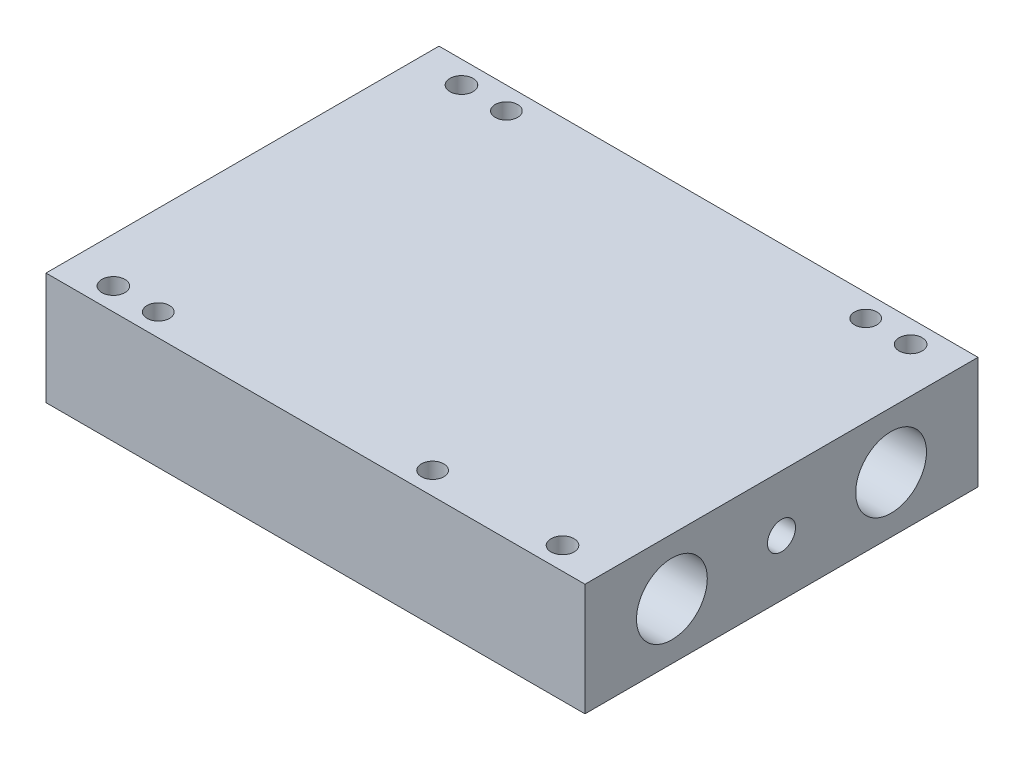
ISO-10303-21;
HEADER;
FILE_DESCRIPTION(('STEP AP214'),'2;1');
FILE_NAME('part.step','',(''),(''),'','','');
FILE_SCHEMA(('AUTOMOTIVE_DESIGN { 1 0 10303 214 1 1 1 1 }'));
ENDSEC;
DATA;
#1=APPLICATION_CONTEXT('core data for automotive mechanical design processes');
#2=APPLICATION_PROTOCOL_DEFINITION('international standard','automotive_design',2000,#1);
#3=PRODUCT_CONTEXT('',#1,'mechanical');
#4=PRODUCT('Part','Part','',(#3));
#5=PRODUCT_RELATED_PRODUCT_CATEGORY('part','',(#4));
#6=PRODUCT_DEFINITION_FORMATION('','',#4);
#7=PRODUCT_DEFINITION_CONTEXT('part definition',#1,'design');
#8=PRODUCT_DEFINITION('design','',#6,#7);
#9=PRODUCT_DEFINITION_SHAPE('','',#8);
#10=(LENGTH_UNIT() NAMED_UNIT(*) SI_UNIT(.MILLI.,.METRE.));
#11=(NAMED_UNIT(*) PLANE_ANGLE_UNIT() SI_UNIT($,.RADIAN.));
#12=(NAMED_UNIT(*) SI_UNIT($,.STERADIAN.) SOLID_ANGLE_UNIT());
#13=UNCERTAINTY_MEASURE_WITH_UNIT(LENGTH_MEASURE(1.E-05),#10,'distance_accuracy_value','');
#14=(GEOMETRIC_REPRESENTATION_CONTEXT(3) GLOBAL_UNCERTAINTY_ASSIGNED_CONTEXT((#13)) GLOBAL_UNIT_ASSIGNED_CONTEXT((#10,
#11,#12)) REPRESENTATION_CONTEXT('',''));
#15=CARTESIAN_POINT('',(0.,0.,0.));
#16=DIRECTION('',(0.,0.,1.));
#17=DIRECTION('',(1.,0.,0.));
#18=AXIS2_PLACEMENT_3D('',#15,#16,#17);
#19=CARTESIAN_POINT('',(76.2,15.875,-55.5625));
#20=DIRECTION('',(0.,-1.,0.));
#21=DIRECTION('',(0.,0.,-1.));
#22=AXIS2_PLACEMENT_3D('',#19,#20,#21);
#23=PLANE('',#22);
#24=CARTESIAN_POINT('',(-50.8,15.875,-49.2125));
#25=DIRECTION('',(0.,1.,0.));
#26=DIRECTION('',(0.,0.,1.));
#27=AXIS2_PLACEMENT_3D('',#24,#25,#26);
#28=CIRCLE('',#27,3.17500000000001);
#29=CARTESIAN_POINT('',(-50.8,15.875,-46.0375));
#30=VERTEX_POINT('',#29);
#31=EDGE_CURVE('E178',#30,#30,#28,.T.);
#32=ORIENTED_EDGE('',*,*,#31,.F.);
#33=EDGE_LOOP('',(#32));
#34=FACE_BOUND('',#33,.T.);
#35=CARTESIAN_POINT('',(-50.8,15.875,49.2125));
#36=DIRECTION('',(0.,1.,0.));
#37=DIRECTION('',(0.,0.,1.));
#38=AXIS2_PLACEMENT_3D('',#35,#36,#37);
#39=CIRCLE('',#38,3.17500000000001);
#40=CARTESIAN_POINT('',(-50.8,15.875,52.3875));
#41=VERTEX_POINT('',#40);
#42=EDGE_CURVE('E182',#41,#41,#39,.T.);
#43=ORIENTED_EDGE('',*,*,#42,.F.);
#44=EDGE_LOOP('',(#43));
#45=FACE_BOUND('',#44,.T.);
#46=CARTESIAN_POINT('',(50.8,15.875,-49.2125));
#47=DIRECTION('',(0.,1.,0.));
#48=DIRECTION('',(0.,0.,1.));
#49=AXIS2_PLACEMENT_3D('',#46,#47,#48);
#50=CIRCLE('',#49,3.17500000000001);
#51=CARTESIAN_POINT('',(50.8,15.875,-46.0375));
#52=VERTEX_POINT('',#51);
#53=EDGE_CURVE('E186',#52,#52,#50,.T.);
#54=ORIENTED_EDGE('',*,*,#53,.F.);
#55=EDGE_LOOP('',(#54));
#56=FACE_BOUND('',#55,.T.);
#57=CARTESIAN_POINT('',(26.7628980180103,15.875,49.2125));
#58=DIRECTION('',(0.,1.,0.));
#59=DIRECTION('',(0.,0.,1.));
#60=AXIS2_PLACEMENT_3D('',#57,#58,#59);
#61=CIRCLE('',#60,3.17500000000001);
#62=CARTESIAN_POINT('',(26.7628980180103,15.875,52.3875));
#63=VERTEX_POINT('',#62);
#64=EDGE_CURVE('E190',#63,#63,#61,.T.);
#65=ORIENTED_EDGE('',*,*,#64,.F.);
#66=EDGE_LOOP('',(#65));
#67=FACE_BOUND('',#66,.T.);
#68=CARTESIAN_POINT('',(-63.5,15.875,-49.2125));
#69=DIRECTION('',(0.,1.,0.));
#70=DIRECTION('',(0.,0.,1.));
#71=AXIS2_PLACEMENT_3D('',#68,#69,#70);
#72=CIRCLE('',#71,3.2639);
#73=CARTESIAN_POINT('',(-63.5,15.875,-45.9486));
#74=VERTEX_POINT('',#73);
#75=EDGE_CURVE('E108',#74,#74,#72,.T.);
#76=ORIENTED_EDGE('',*,*,#75,.F.);
#77=EDGE_LOOP('',(#76));
#78=FACE_BOUND('',#77,.T.);
#79=CARTESIAN_POINT('',(63.5,15.875,-49.2125));
#80=DIRECTION('',(0.,1.,0.));
#81=DIRECTION('',(0.,0.,1.));
#82=AXIS2_PLACEMENT_3D('',#79,#80,#81);
#83=CIRCLE('',#82,3.2639);
#84=CARTESIAN_POINT('',(63.5,15.875,-45.9486));
#85=VERTEX_POINT('',#84);
#86=EDGE_CURVE('E107',#85,#85,#83,.T.);
#87=ORIENTED_EDGE('',*,*,#86,.F.);
#88=EDGE_LOOP('',(#87));
#89=FACE_BOUND('',#88,.T.);
#90=CARTESIAN_POINT('',(63.5,15.875,49.2125));
#91=DIRECTION('',(0.,1.,0.));
#92=DIRECTION('',(0.,0.,1.));
#93=AXIS2_PLACEMENT_3D('',#90,#91,#92);
#94=CIRCLE('',#93,3.2639);
#95=CARTESIAN_POINT('',(63.5,15.875,52.4764));
#96=VERTEX_POINT('',#95);
#97=EDGE_CURVE('E120',#96,#96,#94,.T.);
#98=ORIENTED_EDGE('',*,*,#97,.F.);
#99=EDGE_LOOP('',(#98));
#100=FACE_BOUND('',#99,.T.);
#101=CARTESIAN_POINT('',(-63.5,15.875,49.2125));
#102=DIRECTION('',(0.,1.,0.));
#103=DIRECTION('',(0.,0.,1.));
#104=AXIS2_PLACEMENT_3D('',#101,#102,#103);
#105=CIRCLE('',#104,3.2639);
#106=CARTESIAN_POINT('',(-63.5,15.875,52.4764));
#107=VERTEX_POINT('',#106);
#108=EDGE_CURVE('E126',#107,#107,#105,.T.);
#109=ORIENTED_EDGE('',*,*,#108,.F.);
#110=EDGE_LOOP('',(#109));
#111=FACE_BOUND('',#110,.T.);
#112=DIRECTION('',(0.,0.,1.));
#113=VECTOR('',#112,1.);
#114=CARTESIAN_POINT('',(-76.2,15.875,-55.5625));
#115=LINE('',#114,#113);
#116=CARTESIAN_POINT('',(-76.2,15.875,-55.5625));
#117=VERTEX_POINT('',#116);
#118=CARTESIAN_POINT('',(-76.2,15.875,55.5625));
#119=VERTEX_POINT('',#118);
#120=EDGE_CURVE('E132',#117,#119,#115,.T.);
#121=ORIENTED_EDGE('',*,*,#120,.T.);
#122=DIRECTION('',(-1.,0.,0.));
#123=VECTOR('',#122,1.);
#124=CARTESIAN_POINT('',(76.2,15.875,55.5625));
#125=LINE('',#124,#123);
#126=CARTESIAN_POINT('',(76.2,15.875,55.5625));
#127=VERTEX_POINT('',#126);
#128=EDGE_CURVE('E11',#127,#119,#125,.T.);
#129=ORIENTED_EDGE('',*,*,#128,.F.);
#130=DIRECTION('',(0.,0.,1.));
#131=VECTOR('',#130,1.);
#132=CARTESIAN_POINT('',(76.2,15.875,-55.5625));
#133=LINE('',#132,#131);
#134=CARTESIAN_POINT('',(76.2,15.875,-55.5625));
#135=VERTEX_POINT('',#134);
#136=EDGE_CURVE('E133',#135,#127,#133,.T.);
#137=ORIENTED_EDGE('',*,*,#136,.F.);
#138=DIRECTION('',(-1.,0.,0.));
#139=VECTOR('',#138,1.);
#140=CARTESIAN_POINT('',(76.2,15.875,-55.5625));
#141=LINE('',#140,#139);
#142=EDGE_CURVE('E139',#135,#117,#141,.T.);
#143=ORIENTED_EDGE('',*,*,#142,.T.);
#144=EDGE_LOOP('',(#121,#129,#137,#143));
#145=FACE_BOUND('',#144,.T.);
#146=ADVANCED_FACE('F37',(#34,#45,#56,#67,#78,#89,#100,#111,#145),#23,.F.);
#147=CARTESIAN_POINT('',(76.2,15.875,55.5625));
#148=DIRECTION('',(0.,0.,-1.));
#149=DIRECTION('',(-1.,0.,0.));
#150=AXIS2_PLACEMENT_3D('',#147,#148,#149);
#151=PLANE('',#150);
#152=DIRECTION('',(0.,-1.,0.));
#153=VECTOR('',#152,1.);
#154=CARTESIAN_POINT('',(-76.2,15.875,55.5625));
#155=LINE('',#154,#153);
#156=CARTESIAN_POINT('',(-76.2,-15.875,55.5625));
#157=VERTEX_POINT('',#156);
#158=EDGE_CURVE('E142',#119,#157,#155,.T.);
#159=ORIENTED_EDGE('',*,*,#158,.T.);
#160=DIRECTION('',(-1.,0.,0.));
#161=VECTOR('',#160,1.);
#162=CARTESIAN_POINT('',(76.2,-15.875,55.5625));
#163=LINE('',#162,#161);
#164=CARTESIAN_POINT('',(76.2,-15.875,55.5625));
#165=VERTEX_POINT('',#164);
#166=EDGE_CURVE('E45',#165,#157,#163,.T.);
#167=ORIENTED_EDGE('',*,*,#166,.F.);
#168=DIRECTION('',(0.,-1.,0.));
#169=VECTOR('',#168,1.);
#170=CARTESIAN_POINT('',(76.2,15.875,55.5625));
#171=LINE('',#170,#169);
#172=EDGE_CURVE('E84',#127,#165,#171,.T.);
#173=ORIENTED_EDGE('',*,*,#172,.F.);
#174=ORIENTED_EDGE('',*,*,#128,.T.);
#175=EDGE_LOOP('',(#159,#167,#173,#174));
#176=FACE_BOUND('',#175,.T.);
#177=ADVANCED_FACE('F166',(#176),#151,.F.);
#178=CARTESIAN_POINT('',(76.2,-15.875,55.5625));
#179=DIRECTION('',(0.,1.,0.));
#180=DIRECTION('',(0.,0.,1.));
#181=AXIS2_PLACEMENT_3D('',#178,#179,#180);
#182=PLANE('',#181);
#183=CARTESIAN_POINT('',(-50.8,-15.875,-49.2125));
#184=DIRECTION('',(0.,1.,0.));
#185=DIRECTION('',(0.,0.,1.));
#186=AXIS2_PLACEMENT_3D('',#183,#184,#185);
#187=CIRCLE('',#186,3.17500000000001);
#188=CARTESIAN_POINT('',(-50.8,-15.875,-46.0375));
#189=VERTEX_POINT('',#188);
#190=EDGE_CURVE('E234',#189,#189,#187,.T.);
#191=ORIENTED_EDGE('',*,*,#190,.T.);
#192=EDGE_LOOP('',(#191));
#193=FACE_BOUND('',#192,.T.);
#194=CARTESIAN_POINT('',(-50.8,-15.875,49.2125));
#195=DIRECTION('',(0.,1.,0.));
#196=DIRECTION('',(0.,0.,1.));
#197=AXIS2_PLACEMENT_3D('',#194,#195,#196);
#198=CIRCLE('',#197,3.17500000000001);
#199=CARTESIAN_POINT('',(-50.8,-15.875,52.3875));
#200=VERTEX_POINT('',#199);
#201=EDGE_CURVE('E245',#200,#200,#198,.T.);
#202=ORIENTED_EDGE('',*,*,#201,.T.);
#203=EDGE_LOOP('',(#202));
#204=FACE_BOUND('',#203,.T.);
#205=CARTESIAN_POINT('',(50.8,-15.875,-49.2125));
#206=DIRECTION('',(0.,1.,0.));
#207=DIRECTION('',(0.,0.,1.));
#208=AXIS2_PLACEMENT_3D('',#205,#206,#207);
#209=CIRCLE('',#208,3.17500000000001);
#210=CARTESIAN_POINT('',(50.8,-15.875,-46.0375));
#211=VERTEX_POINT('',#210);
#212=EDGE_CURVE('E249',#211,#211,#209,.T.);
#213=ORIENTED_EDGE('',*,*,#212,.T.);
#214=EDGE_LOOP('',(#213));
#215=FACE_BOUND('',#214,.T.);
#216=CARTESIAN_POINT('',(26.7628980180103,-15.875,49.2125));
#217=DIRECTION('',(0.,1.,0.));
#218=DIRECTION('',(0.,0.,1.));
#219=AXIS2_PLACEMENT_3D('',#216,#217,#218);
#220=CIRCLE('',#219,3.17500000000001);
#221=CARTESIAN_POINT('',(26.7628980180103,-15.875,52.3875));
#222=VERTEX_POINT('',#221);
#223=EDGE_CURVE('E114',#222,#222,#220,.T.);
#224=ORIENTED_EDGE('',*,*,#223,.T.);
#225=EDGE_LOOP('',(#224));
#226=FACE_BOUND('',#225,.T.);
#227=DIRECTION('',(0.,0.,-1.));
#228=VECTOR('',#227,1.);
#229=CARTESIAN_POINT('',(-76.2,-15.875,55.5625));
#230=LINE('',#229,#228);
#231=CARTESIAN_POINT('',(-76.2,-15.875,-55.5625));
#232=VERTEX_POINT('',#231);
#233=EDGE_CURVE('E71',#157,#232,#230,.T.);
#234=ORIENTED_EDGE('',*,*,#233,.T.);
#235=DIRECTION('',(-1.,0.,0.));
#236=VECTOR('',#235,1.);
#237=CARTESIAN_POINT('',(76.2,-15.875,-55.5625));
#238=LINE('',#237,#236);
#239=CARTESIAN_POINT('',(76.2,-15.875,-55.5625));
#240=VERTEX_POINT('',#239);
#241=EDGE_CURVE('E147',#240,#232,#238,.T.);
#242=ORIENTED_EDGE('',*,*,#241,.F.);
#243=DIRECTION('',(0.,0.,-1.));
#244=VECTOR('',#243,1.);
#245=CARTESIAN_POINT('',(76.2,-15.875,55.5625));
#246=LINE('',#245,#244);
#247=EDGE_CURVE('E136',#165,#240,#246,.T.);
#248=ORIENTED_EDGE('',*,*,#247,.F.);
#249=ORIENTED_EDGE('',*,*,#166,.T.);
#250=EDGE_LOOP('',(#234,#242,#248,#249));
#251=FACE_BOUND('',#250,.T.);
#252=ADVANCED_FACE('F149',(#193,#204,#215,#226,#251),#182,.F.);
#253=CARTESIAN_POINT('',(76.2,-15.875,-55.5625));
#254=DIRECTION('',(0.,0.,1.));
#255=DIRECTION('',(1.,0.,0.));
#256=AXIS2_PLACEMENT_3D('',#253,#254,#255);
#257=PLANE('',#256);
#258=DIRECTION('',(0.,1.,0.));
#259=VECTOR('',#258,1.);
#260=CARTESIAN_POINT('',(-76.2,-15.875,-55.5625));
#261=LINE('',#260,#259);
#262=EDGE_CURVE('E77',#232,#117,#261,.T.);
#263=ORIENTED_EDGE('',*,*,#262,.T.);
#264=ORIENTED_EDGE('',*,*,#142,.F.);
#265=DIRECTION('',(0.,1.,0.));
#266=VECTOR('',#265,1.);
#267=CARTESIAN_POINT('',(76.2,-15.875,-55.5625));
#268=LINE('',#267,#266);
#269=EDGE_CURVE('E53',#240,#135,#268,.T.);
#270=ORIENTED_EDGE('',*,*,#269,.F.);
#271=ORIENTED_EDGE('',*,*,#241,.T.);
#272=EDGE_LOOP('',(#263,#264,#270,#271));
#273=FACE_BOUND('',#272,.T.);
#274=ADVANCED_FACE('F156',(#273),#257,.F.);
#275=CARTESIAN_POINT('',(76.2,15.875,55.5625));
#276=DIRECTION('',(1.,0.,0.));
#277=DIRECTION('',(0.,0.,-1.));
#278=AXIS2_PLACEMENT_3D('',#275,#276,#277);
#279=PLANE('',#278);
#280=CARTESIAN_POINT('',(76.2,0.,0.));
#281=DIRECTION('',(1.,0.,0.));
#282=DIRECTION('',(0.,0.,-1.));
#283=AXIS2_PLACEMENT_3D('',#280,#281,#282);
#284=CIRCLE('',#283,3.96875);
#285=CARTESIAN_POINT('',(76.2,0.,-3.96875));
#286=VERTEX_POINT('',#285);
#287=EDGE_CURVE('E403',#286,#286,#284,.T.);
#288=ORIENTED_EDGE('',*,*,#287,.F.);
#289=EDGE_LOOP('',(#288));
#290=FACE_BOUND('',#289,.T.);
#291=CARTESIAN_POINT('',(76.2,0.,-30.988));
#292=DIRECTION('',(1.,0.,0.));
#293=DIRECTION('',(0.,0.,-1.));
#294=AXIS2_PLACEMENT_3D('',#291,#292,#293);
#295=CIRCLE('',#294,10.0076);
#296=CARTESIAN_POINT('',(76.2,0.,-40.9956));
#297=VERTEX_POINT('',#296);
#298=EDGE_CURVE('E239',#297,#297,#295,.T.);
#299=ORIENTED_EDGE('',*,*,#298,.F.);
#300=EDGE_LOOP('',(#299));
#301=FACE_BOUND('',#300,.T.);
#302=CARTESIAN_POINT('',(76.2,0.,30.988));
#303=DIRECTION('',(1.,0.,0.));
#304=DIRECTION('',(0.,0.,-1.));
#305=AXIS2_PLACEMENT_3D('',#302,#303,#304);
#306=CIRCLE('',#305,10.0076);
#307=CARTESIAN_POINT('',(76.2,0.,20.9804));
#308=VERTEX_POINT('',#307);
#309=EDGE_CURVE('E232',#308,#308,#306,.T.);
#310=ORIENTED_EDGE('',*,*,#309,.F.);
#311=EDGE_LOOP('',(#310));
#312=FACE_BOUND('',#311,.T.);
#313=ORIENTED_EDGE('',*,*,#136,.T.);
#314=ORIENTED_EDGE('',*,*,#172,.T.);
#315=ORIENTED_EDGE('',*,*,#247,.T.);
#316=ORIENTED_EDGE('',*,*,#269,.T.);
#317=EDGE_LOOP('',(#313,#314,#315,#316));
#318=FACE_BOUND('',#317,.T.);
#319=ADVANCED_FACE('F158',(#290,#301,#312,#318),#279,.T.);
#320=CARTESIAN_POINT('',(-76.2,15.875,55.5625));
#321=DIRECTION('',(1.,0.,0.));
#322=DIRECTION('',(0.,0.,-1.));
#323=AXIS2_PLACEMENT_3D('',#320,#321,#322);
#324=PLANE('',#323);
#325=CARTESIAN_POINT('',(-76.2,0.,0.));
#326=DIRECTION('',(1.,0.,0.));
#327=DIRECTION('',(0.,0.,-1.));
#328=AXIS2_PLACEMENT_3D('',#325,#326,#327);
#329=CIRCLE('',#328,3.96875);
#330=CARTESIAN_POINT('',(-76.2,0.,-3.96875));
#331=VERTEX_POINT('',#330);
#332=EDGE_CURVE('E223',#331,#331,#329,.T.);
#333=ORIENTED_EDGE('',*,*,#332,.T.);
#334=EDGE_LOOP('',(#333));
#335=FACE_BOUND('',#334,.T.);
#336=CARTESIAN_POINT('',(-76.2,0.,-30.988));
#337=DIRECTION('',(1.,0.,0.));
#338=DIRECTION('',(0.,0.,-1.));
#339=AXIS2_PLACEMENT_3D('',#336,#337,#338);
#340=CIRCLE('',#339,10.0076);
#341=CARTESIAN_POINT('',(-76.2,0.,-40.9956));
#342=VERTEX_POINT('',#341);
#343=EDGE_CURVE('E227',#342,#342,#340,.T.);
#344=ORIENTED_EDGE('',*,*,#343,.T.);
#345=EDGE_LOOP('',(#344));
#346=FACE_BOUND('',#345,.T.);
#347=CARTESIAN_POINT('',(-76.2,0.,30.988));
#348=DIRECTION('',(1.,0.,0.));
#349=DIRECTION('',(0.,0.,-1.));
#350=AXIS2_PLACEMENT_3D('',#347,#348,#349);
#351=CIRCLE('',#350,10.0076);
#352=CARTESIAN_POINT('',(-76.2,0.,20.9804));
#353=VERTEX_POINT('',#352);
#354=EDGE_CURVE('E230',#353,#353,#351,.T.);
#355=ORIENTED_EDGE('',*,*,#354,.T.);
#356=EDGE_LOOP('',(#355));
#357=FACE_BOUND('',#356,.T.);
#358=ORIENTED_EDGE('',*,*,#120,.F.);
#359=ORIENTED_EDGE('',*,*,#262,.F.);
#360=ORIENTED_EDGE('',*,*,#233,.F.);
#361=ORIENTED_EDGE('',*,*,#158,.F.);
#362=EDGE_LOOP('',(#358,#359,#360,#361));
#363=FACE_BOUND('',#362,.T.);
#364=ADVANCED_FACE('F152',(#335,#346,#357,#363),#324,.F.);
#365=CARTESIAN_POINT('',(-63.5,-3.8862,49.2125));
#366=DIRECTION('',(0.,1.,0.));
#367=DIRECTION('',(0.,0.,1.));
#368=AXIS2_PLACEMENT_3D('',#365,#366,#367);
#369=CONICAL_SURFACE('',#368,3.26389999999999,1.02974425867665);
#370=CARTESIAN_POINT('',(-63.5,-5.84734897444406,49.2125));
#371=VERTEX_POINT('',#370);
#372=VERTEX_LOOP('',#371);
#373=FACE_BOUND('',#372,.T.);
#374=CARTESIAN_POINT('',(-63.5,-3.8862,49.2125));
#375=DIRECTION('',(0.,1.,0.));
#376=DIRECTION('',(0.,0.,1.));
#377=AXIS2_PLACEMENT_3D('',#374,#375,#376);
#378=CIRCLE('',#377,3.26389999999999);
#379=CARTESIAN_POINT('',(-63.5,-3.8862,52.4764));
#380=VERTEX_POINT('',#379);
#381=EDGE_CURVE('E129',#380,#380,#378,.T.);
#382=ORIENTED_EDGE('',*,*,#381,.T.);
#383=EDGE_LOOP('',(#382));
#384=FACE_BOUND('',#383,.T.);
#385=ADVANCED_FACE('F202',(#373,#384),#369,.F.);
#386=CARTESIAN_POINT('',(-63.5,15.875,49.2125));
#387=DIRECTION('',(0.,1.,0.));
#388=DIRECTION('',(0.,0.,1.));
#389=AXIS2_PLACEMENT_3D('',#386,#387,#388);
#390=CYLINDRICAL_SURFACE('',#389,3.2639);
#391=ORIENTED_EDGE('',*,*,#381,.F.);
#392=EDGE_LOOP('',(#391));
#393=FACE_BOUND('',#392,.T.);
#394=ORIENTED_EDGE('',*,*,#108,.T.);
#395=EDGE_LOOP('',(#394));
#396=FACE_BOUND('',#395,.T.);
#397=ADVANCED_FACE('F199',(#393,#396),#390,.F.);
#398=CARTESIAN_POINT('',(63.5,-3.8862,49.2125));
#399=DIRECTION('',(0.,1.,0.));
#400=DIRECTION('',(0.,0.,1.));
#401=AXIS2_PLACEMENT_3D('',#398,#399,#400);
#402=CONICAL_SURFACE('',#401,3.2639,1.02974425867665);
#403=CARTESIAN_POINT('',(63.5,-5.84734897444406,49.2125));
#404=VERTEX_POINT('',#403);
#405=VERTEX_LOOP('',#404);
#406=FACE_BOUND('',#405,.T.);
#407=CARTESIAN_POINT('',(63.5,-3.8862,49.2125));
#408=DIRECTION('',(0.,1.,0.));
#409=DIRECTION('',(0.,0.,1.));
#410=AXIS2_PLACEMENT_3D('',#407,#408,#409);
#411=CIRCLE('',#410,3.2639);
#412=CARTESIAN_POINT('',(63.5,-3.8862,52.4764));
#413=VERTEX_POINT('',#412);
#414=EDGE_CURVE('E123',#413,#413,#411,.T.);
#415=ORIENTED_EDGE('',*,*,#414,.T.);
#416=EDGE_LOOP('',(#415));
#417=FACE_BOUND('',#416,.T.);
#418=ADVANCED_FACE('F201',(#406,#417),#402,.F.);
#419=CARTESIAN_POINT('',(63.5,15.875,49.2125));
#420=DIRECTION('',(0.,1.,0.));
#421=DIRECTION('',(0.,0.,1.));
#422=AXIS2_PLACEMENT_3D('',#419,#420,#421);
#423=CYLINDRICAL_SURFACE('',#422,3.2639);
#424=ORIENTED_EDGE('',*,*,#414,.F.);
#425=EDGE_LOOP('',(#424));
#426=FACE_BOUND('',#425,.T.);
#427=ORIENTED_EDGE('',*,*,#97,.T.);
#428=EDGE_LOOP('',(#427));
#429=FACE_BOUND('',#428,.T.);
#430=ADVANCED_FACE('F209',(#426,#429),#423,.F.);
#431=CARTESIAN_POINT('',(63.5,-3.8862,-49.2125));
#432=DIRECTION('',(0.,1.,0.));
#433=DIRECTION('',(0.,0.,1.));
#434=AXIS2_PLACEMENT_3D('',#431,#432,#433);
#435=CONICAL_SURFACE('',#434,3.2639,1.02974425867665);
#436=CARTESIAN_POINT('',(63.5,-5.84734897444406,-49.2125));
#437=VERTEX_POINT('',#436);
#438=VERTEX_LOOP('',#437);
#439=FACE_BOUND('',#438,.T.);
#440=CARTESIAN_POINT('',(63.5,-3.8862,-49.2125));
#441=DIRECTION('',(0.,1.,0.));
#442=DIRECTION('',(0.,0.,1.));
#443=AXIS2_PLACEMENT_3D('',#440,#441,#442);
#444=CIRCLE('',#443,3.2639);
#445=CARTESIAN_POINT('',(63.5,-3.8862,-45.9486));
#446=VERTEX_POINT('',#445);
#447=EDGE_CURVE('E111',#446,#446,#444,.T.);
#448=ORIENTED_EDGE('',*,*,#447,.T.);
#449=EDGE_LOOP('',(#448));
#450=FACE_BOUND('',#449,.T.);
#451=ADVANCED_FACE('F273',(#439,#450),#435,.F.);
#452=CARTESIAN_POINT('',(63.5,15.875,-49.2125));
#453=DIRECTION('',(0.,1.,0.));
#454=DIRECTION('',(0.,0.,1.));
#455=AXIS2_PLACEMENT_3D('',#452,#453,#454);
#456=CYLINDRICAL_SURFACE('',#455,3.2639);
#457=ORIENTED_EDGE('',*,*,#447,.F.);
#458=EDGE_LOOP('',(#457));
#459=FACE_BOUND('',#458,.T.);
#460=ORIENTED_EDGE('',*,*,#86,.T.);
#461=EDGE_LOOP('',(#460));
#462=FACE_BOUND('',#461,.T.);
#463=ADVANCED_FACE('F101',(#459,#462),#456,.F.);
#464=CARTESIAN_POINT('',(-63.5,-3.8862,-49.2125));
#465=DIRECTION('',(0.,1.,0.));
#466=DIRECTION('',(0.,0.,1.));
#467=AXIS2_PLACEMENT_3D('',#464,#465,#466);
#468=CONICAL_SURFACE('',#467,3.26389999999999,1.02974425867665);
#469=CARTESIAN_POINT('',(-63.5,-5.84734897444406,-49.2125));
#470=VERTEX_POINT('',#469);
#471=VERTEX_LOOP('',#470);
#472=FACE_BOUND('',#471,.T.);
#473=CARTESIAN_POINT('',(-63.5,-3.8862,-49.2125));
#474=DIRECTION('',(0.,1.,0.));
#475=DIRECTION('',(0.,0.,1.));
#476=AXIS2_PLACEMENT_3D('',#473,#474,#475);
#477=CIRCLE('',#476,3.26389999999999);
#478=CARTESIAN_POINT('',(-63.5,-3.8862,-45.9486));
#479=VERTEX_POINT('',#478);
#480=EDGE_CURVE('E105',#479,#479,#477,.T.);
#481=ORIENTED_EDGE('',*,*,#480,.T.);
#482=EDGE_LOOP('',(#481));
#483=FACE_BOUND('',#482,.T.);
#484=ADVANCED_FACE('F97',(#472,#483),#468,.F.);
#485=CARTESIAN_POINT('',(-63.5,15.875,-49.2125));
#486=DIRECTION('',(0.,1.,0.));
#487=DIRECTION('',(0.,0.,1.));
#488=AXIS2_PLACEMENT_3D('',#485,#486,#487);
#489=CYLINDRICAL_SURFACE('',#488,3.2639);
#490=ORIENTED_EDGE('',*,*,#480,.F.);
#491=EDGE_LOOP('',(#490));
#492=FACE_BOUND('',#491,.T.);
#493=ORIENTED_EDGE('',*,*,#75,.T.);
#494=EDGE_LOOP('',(#493));
#495=FACE_BOUND('',#494,.T.);
#496=ADVANCED_FACE('F100',(#492,#495),#489,.F.);
#497=CARTESIAN_POINT('',(26.7628980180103,15.875,49.2125));
#498=DIRECTION('',(0.,1.,0.));
#499=DIRECTION('',(0.,0.,1.));
#500=AXIS2_PLACEMENT_3D('',#497,#498,#499);
#501=CYLINDRICAL_SURFACE('',#500,3.17500000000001);
#502=ORIENTED_EDGE('',*,*,#223,.F.);
#503=EDGE_LOOP('',(#502));
#504=FACE_BOUND('',#503,.T.);
#505=ORIENTED_EDGE('',*,*,#64,.T.);
#506=EDGE_LOOP('',(#505));
#507=FACE_BOUND('',#506,.T.);
#508=ADVANCED_FACE('F256',(#504,#507),#501,.F.);
#509=CARTESIAN_POINT('',(50.8,15.875,-49.2125));
#510=DIRECTION('',(0.,1.,0.));
#511=DIRECTION('',(0.,0.,1.));
#512=AXIS2_PLACEMENT_3D('',#509,#510,#511);
#513=CYLINDRICAL_SURFACE('',#512,3.17500000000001);
#514=ORIENTED_EDGE('',*,*,#212,.F.);
#515=EDGE_LOOP('',(#514));
#516=FACE_BOUND('',#515,.T.);
#517=ORIENTED_EDGE('',*,*,#53,.T.);
#518=EDGE_LOOP('',(#517));
#519=FACE_BOUND('',#518,.T.);
#520=ADVANCED_FACE('F259',(#516,#519),#513,.F.);
#521=CARTESIAN_POINT('',(-50.8,15.875,49.2125));
#522=DIRECTION('',(0.,1.,0.));
#523=DIRECTION('',(0.,0.,1.));
#524=AXIS2_PLACEMENT_3D('',#521,#522,#523);
#525=CYLINDRICAL_SURFACE('',#524,3.17500000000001);
#526=ORIENTED_EDGE('',*,*,#201,.F.);
#527=EDGE_LOOP('',(#526));
#528=FACE_BOUND('',#527,.T.);
#529=ORIENTED_EDGE('',*,*,#42,.T.);
#530=EDGE_LOOP('',(#529));
#531=FACE_BOUND('',#530,.T.);
#532=ADVANCED_FACE('F265',(#528,#531),#525,.F.);
#533=CARTESIAN_POINT('',(-50.8,15.875,-49.2125));
#534=DIRECTION('',(0.,1.,0.));
#535=DIRECTION('',(0.,0.,1.));
#536=AXIS2_PLACEMENT_3D('',#533,#534,#535);
#537=CYLINDRICAL_SURFACE('',#536,3.17500000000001);
#538=ORIENTED_EDGE('',*,*,#190,.F.);
#539=EDGE_LOOP('',(#538));
#540=FACE_BOUND('',#539,.T.);
#541=ORIENTED_EDGE('',*,*,#31,.T.);
#542=EDGE_LOOP('',(#541));
#543=FACE_BOUND('',#542,.T.);
#544=ADVANCED_FACE('F357',(#540,#543),#537,.F.);
#545=CARTESIAN_POINT('',(-76.2,0.,30.988));
#546=DIRECTION('',(1.,0.,0.));
#547=DIRECTION('',(0.,0.,-1.));
#548=AXIS2_PLACEMENT_3D('',#545,#546,#547);
#549=CYLINDRICAL_SURFACE('',#548,10.0076);
#550=CARTESIAN_POINT('',(-76.2,0.,20.9804));
#551=CARTESIAN_POINT('',(-74.6125,0.,20.9804));
#552=CARTESIAN_POINT('',(-73.025,0.,20.9804));
#553=CARTESIAN_POINT('',(-69.85,0.,20.9804));
#554=CARTESIAN_POINT('',(-68.2625,0.,20.9804));
#555=CARTESIAN_POINT('',(-65.0875,0.,20.9804));
#556=CARTESIAN_POINT('',(-63.5,0.,20.9804));
#557=CARTESIAN_POINT('',(-60.325,0.,20.9804));
#558=CARTESIAN_POINT('',(-58.7375,0.,20.9804));
#559=CARTESIAN_POINT('',(-55.5625,0.,20.9804));
#560=CARTESIAN_POINT('',(-53.975,0.,20.9804));
#561=CARTESIAN_POINT('',(-50.8,0.,20.9804));
#562=CARTESIAN_POINT('',(-49.2125,0.,20.9804));
#563=CARTESIAN_POINT('',(-46.0375,0.,20.9804));
#564=CARTESIAN_POINT('',(-44.45,0.,20.9804));
#565=CARTESIAN_POINT('',(-41.275,0.,20.9804));
#566=CARTESIAN_POINT('',(-39.6875,0.,20.9804));
#567=CARTESIAN_POINT('',(-36.5125,0.,20.9804));
#568=CARTESIAN_POINT('',(-34.925,0.,20.9804));
#569=CARTESIAN_POINT('',(-31.75,0.,20.9804));
#570=CARTESIAN_POINT('',(-30.1625,0.,20.9804));
#571=CARTESIAN_POINT('',(-26.9875,0.,20.9804));
#572=CARTESIAN_POINT('',(-25.4,0.,20.9804));
#573=CARTESIAN_POINT('',(-22.225,0.,20.9804));
#574=CARTESIAN_POINT('',(-20.6375,0.,20.9804));
#575=CARTESIAN_POINT('',(-17.4625,0.,20.9804));
#576=CARTESIAN_POINT('',(-15.875,0.,20.9804));
#577=CARTESIAN_POINT('',(-12.7,0.,20.9804));
#578=CARTESIAN_POINT('',(-11.1125,0.,20.9804));
#579=CARTESIAN_POINT('',(-7.93750000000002,0.,20.9804));
#580=CARTESIAN_POINT('',(-6.35000000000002,0.,20.9804));
#581=CARTESIAN_POINT('',(-3.17500000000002,0.,20.9804));
#582=CARTESIAN_POINT('',(-1.58750000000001,0.,20.9804));
#583=CARTESIAN_POINT('',(1.58749999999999,0.,20.9804));
#584=CARTESIAN_POINT('',(3.17499999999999,0.,20.9804));
#585=CARTESIAN_POINT('',(6.34999999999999,0.,20.9804));
#586=CARTESIAN_POINT('',(7.93749999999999,0.,20.9804));
#587=CARTESIAN_POINT('',(11.1125,0.,20.9804));
#588=CARTESIAN_POINT('',(12.7,0.,20.9804));
#589=CARTESIAN_POINT('',(15.875,0.,20.9804));
#590=CARTESIAN_POINT('',(17.4625,0.,20.9804));
#591=CARTESIAN_POINT('',(20.6375,0.,20.9804));
#592=CARTESIAN_POINT('',(22.225,0.,20.9804));
#593=CARTESIAN_POINT('',(25.4,0.,20.9804));
#594=CARTESIAN_POINT('',(26.9875,0.,20.9804));
#595=CARTESIAN_POINT('',(30.1625,0.,20.9804));
#596=CARTESIAN_POINT('',(31.75,0.,20.9804));
#597=CARTESIAN_POINT('',(34.925,0.,20.9804));
#598=CARTESIAN_POINT('',(36.5125,0.,20.9804));
#599=CARTESIAN_POINT('',(39.6875,0.,20.9804));
#600=CARTESIAN_POINT('',(41.275,0.,20.9804));
#601=CARTESIAN_POINT('',(44.45,0.,20.9804));
#602=CARTESIAN_POINT('',(46.0375,0.,20.9804));
#603=CARTESIAN_POINT('',(49.2125,0.,20.9804));
#604=CARTESIAN_POINT('',(50.8,0.,20.9804));
#605=CARTESIAN_POINT('',(53.975,0.,20.9804));
#606=CARTESIAN_POINT('',(55.5625,0.,20.9804));
#607=CARTESIAN_POINT('',(58.7375,0.,20.9804));
#608=CARTESIAN_POINT('',(60.325,0.,20.9804));
#609=CARTESIAN_POINT('',(63.5,0.,20.9804));
#610=CARTESIAN_POINT('',(65.0875,0.,20.9804));
#611=CARTESIAN_POINT('',(68.2625,0.,20.9804));
#612=CARTESIAN_POINT('',(69.85,0.,20.9804));
#613=CARTESIAN_POINT('',(73.025,0.,20.9804));
#614=CARTESIAN_POINT('',(74.6125,0.,20.9804));
#615=CARTESIAN_POINT('',(76.2,0.,20.9804));
#616=B_SPLINE_CURVE_WITH_KNOTS('',3,(#550,#551,#552,#553,#554,#555,#556,#557,#558,#559,#560,
#561,#562,#563,#564,#565,#566,#567,#568,#569,#570,#571,#572,#573,#574,#575,#576,#577,#578,#579,
#580,#581,#582,#583,#584,#585,#586,#587,#588,#589,#590,#591,#592,#593,#594,#595,#596,#597,#598,
#599,#600,#601,#602,#603,#604,#605,#606,#607,#608,#609,#610,#611,#612,#613,#614,#615),
.UNSPECIFIED.,.F.,.F.,(4,2,2,2,2,2,2,2,2,2,2,2,2,2,2,2,2,2,2,2,2,2,2,2,2,2,2,2,2,2,2,2,4),(0.,
4.7625,9.52500000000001,14.2875,19.05,23.8125,28.575,33.3375,38.1,42.8625,47.625,52.3875,57.15,
61.9125,66.675,71.4375,76.2,80.9625,85.725,90.4875,95.25,100.0125,104.775,109.5375,114.3,
119.0625,123.825,128.5875,133.35,138.1125,142.875,147.6375,152.4),.UNSPECIFIED.);
#617=EDGE_CURVE('BSEAM365',#353,#308,#616,.T.);
#618=ORIENTED_EDGE('',*,*,#354,.F.);
#619=ORIENTED_EDGE('',*,*,#309,.T.);
#620=ORIENTED_EDGE('',*,*,#617,.T.);
#621=ORIENTED_EDGE('',*,*,#617,.F.);
#622=EDGE_LOOP('',(#618,#620,#619,#621));
#623=FACE_BOUND('',#622,.T.);
#624=ADVANCED_FACE('F365',(#623),#549,.F.);
#625=CARTESIAN_POINT('',(-76.2,0.,-30.988));
#626=DIRECTION('',(1.,0.,0.));
#627=DIRECTION('',(0.,0.,-1.));
#628=AXIS2_PLACEMENT_3D('',#625,#626,#627);
#629=CYLINDRICAL_SURFACE('',#628,10.0076);
#630=CARTESIAN_POINT('',(-76.2,0.,-40.9956));
#631=CARTESIAN_POINT('',(-74.6125,0.,-40.9956));
#632=CARTESIAN_POINT('',(-73.025,0.,-40.9956));
#633=CARTESIAN_POINT('',(-69.85,0.,-40.9956));
#634=CARTESIAN_POINT('',(-68.2625,0.,-40.9956));
#635=CARTESIAN_POINT('',(-65.0875,0.,-40.9956));
#636=CARTESIAN_POINT('',(-63.5,0.,-40.9956));
#637=CARTESIAN_POINT('',(-60.325,0.,-40.9956));
#638=CARTESIAN_POINT('',(-58.7375,0.,-40.9956));
#639=CARTESIAN_POINT('',(-55.5625,0.,-40.9956));
#640=CARTESIAN_POINT('',(-53.975,0.,-40.9956));
#641=CARTESIAN_POINT('',(-50.8,0.,-40.9956));
#642=CARTESIAN_POINT('',(-49.2125,0.,-40.9956));
#643=CARTESIAN_POINT('',(-46.0375,0.,-40.9956));
#644=CARTESIAN_POINT('',(-44.45,0.,-40.9956));
#645=CARTESIAN_POINT('',(-41.275,0.,-40.9956));
#646=CARTESIAN_POINT('',(-39.6875,0.,-40.9956));
#647=CARTESIAN_POINT('',(-36.5125,0.,-40.9956));
#648=CARTESIAN_POINT('',(-34.925,0.,-40.9956));
#649=CARTESIAN_POINT('',(-31.75,0.,-40.9956));
#650=CARTESIAN_POINT('',(-30.1625,0.,-40.9956));
#651=CARTESIAN_POINT('',(-26.9875,0.,-40.9956));
#652=CARTESIAN_POINT('',(-25.4,0.,-40.9956));
#653=CARTESIAN_POINT('',(-22.225,0.,-40.9956));
#654=CARTESIAN_POINT('',(-20.6375,0.,-40.9956));
#655=CARTESIAN_POINT('',(-17.4625,0.,-40.9956));
#656=CARTESIAN_POINT('',(-15.875,0.,-40.9956));
#657=CARTESIAN_POINT('',(-12.7,0.,-40.9956));
#658=CARTESIAN_POINT('',(-11.1125,0.,-40.9956));
#659=CARTESIAN_POINT('',(-7.93750000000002,0.,-40.9956));
#660=CARTESIAN_POINT('',(-6.35000000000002,0.,-40.9956));
#661=CARTESIAN_POINT('',(-3.17500000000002,0.,-40.9956));
#662=CARTESIAN_POINT('',(-1.58750000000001,0.,-40.9956));
#663=CARTESIAN_POINT('',(1.58749999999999,0.,-40.9956));
#664=CARTESIAN_POINT('',(3.17499999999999,0.,-40.9956));
#665=CARTESIAN_POINT('',(6.34999999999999,0.,-40.9956));
#666=CARTESIAN_POINT('',(7.93749999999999,0.,-40.9956));
#667=CARTESIAN_POINT('',(11.1125,0.,-40.9956));
#668=CARTESIAN_POINT('',(12.7,0.,-40.9956));
#669=CARTESIAN_POINT('',(15.875,0.,-40.9956));
#670=CARTESIAN_POINT('',(17.4625,0.,-40.9956));
#671=CARTESIAN_POINT('',(20.6375,0.,-40.9956));
#672=CARTESIAN_POINT('',(22.225,0.,-40.9956));
#673=CARTESIAN_POINT('',(25.4,0.,-40.9956));
#674=CARTESIAN_POINT('',(26.9875,0.,-40.9956));
#675=CARTESIAN_POINT('',(30.1625,0.,-40.9956));
#676=CARTESIAN_POINT('',(31.75,0.,-40.9956));
#677=CARTESIAN_POINT('',(34.925,0.,-40.9956));
#678=CARTESIAN_POINT('',(36.5125,0.,-40.9956));
#679=CARTESIAN_POINT('',(39.6875,0.,-40.9956));
#680=CARTESIAN_POINT('',(41.275,0.,-40.9956));
#681=CARTESIAN_POINT('',(44.45,0.,-40.9956));
#682=CARTESIAN_POINT('',(46.0375,0.,-40.9956));
#683=CARTESIAN_POINT('',(49.2125,0.,-40.9956));
#684=CARTESIAN_POINT('',(50.8,0.,-40.9956));
#685=CARTESIAN_POINT('',(53.975,0.,-40.9956));
#686=CARTESIAN_POINT('',(55.5625,0.,-40.9956));
#687=CARTESIAN_POINT('',(58.7375,0.,-40.9956));
#688=CARTESIAN_POINT('',(60.325,0.,-40.9956));
#689=CARTESIAN_POINT('',(63.5,0.,-40.9956));
#690=CARTESIAN_POINT('',(65.0875,0.,-40.9956));
#691=CARTESIAN_POINT('',(68.2625,0.,-40.9956));
#692=CARTESIAN_POINT('',(69.85,0.,-40.9956));
#693=CARTESIAN_POINT('',(73.025,0.,-40.9956));
#694=CARTESIAN_POINT('',(74.6125,0.,-40.9956));
#695=CARTESIAN_POINT('',(76.2,0.,-40.9956));
#696=B_SPLINE_CURVE_WITH_KNOTS('',3,(#630,#631,#632,#633,#634,#635,#636,#637,#638,#639,#640,
#641,#642,#643,#644,#645,#646,#647,#648,#649,#650,#651,#652,#653,#654,#655,#656,#657,#658,#659,
#660,#661,#662,#663,#664,#665,#666,#667,#668,#669,#670,#671,#672,#673,#674,#675,#676,#677,#678,
#679,#680,#681,#682,#683,#684,#685,#686,#687,#688,#689,#690,#691,#692,#693,#694,#695),
.UNSPECIFIED.,.F.,.F.,(4,2,2,2,2,2,2,2,2,2,2,2,2,2,2,2,2,2,2,2,2,2,2,2,2,2,2,2,2,2,2,2,4),(0.,
4.7625,9.52500000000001,14.2875,19.05,23.8125,28.575,33.3375,38.1,42.8625,47.625,52.3875,57.15,
61.9125,66.675,71.4375,76.2,80.9625,85.725,90.4875,95.25,100.0125,104.775,109.5375,114.3,
119.0625,123.825,128.5875,133.35,138.1125,142.875,147.6375,152.4),.UNSPECIFIED.);
#697=EDGE_CURVE('BSEAM375',#342,#297,#696,.T.);
#698=ORIENTED_EDGE('',*,*,#343,.F.);
#699=ORIENTED_EDGE('',*,*,#298,.T.);
#700=ORIENTED_EDGE('',*,*,#697,.T.);
#701=ORIENTED_EDGE('',*,*,#697,.F.);
#702=EDGE_LOOP('',(#698,#700,#699,#701));
#703=FACE_BOUND('',#702,.T.);
#704=ADVANCED_FACE('F375',(#703),#629,.F.);
#705=CARTESIAN_POINT('',(-76.2,0.,0.));
#706=DIRECTION('',(1.,0.,0.));
#707=DIRECTION('',(0.,0.,-1.));
#708=AXIS2_PLACEMENT_3D('',#705,#706,#707);
#709=CYLINDRICAL_SURFACE('',#708,3.96875);
#710=CARTESIAN_POINT('',(-76.2,0.,-3.96875));
#711=CARTESIAN_POINT('',(-74.6125,0.,-3.96875));
#712=CARTESIAN_POINT('',(-73.025,0.,-3.96875));
#713=CARTESIAN_POINT('',(-69.85,0.,-3.96875));
#714=CARTESIAN_POINT('',(-68.2625,0.,-3.96875));
#715=CARTESIAN_POINT('',(-65.0875,0.,-3.96875));
#716=CARTESIAN_POINT('',(-63.5,0.,-3.96875));
#717=CARTESIAN_POINT('',(-60.325,0.,-3.96875));
#718=CARTESIAN_POINT('',(-58.7375,0.,-3.96875));
#719=CARTESIAN_POINT('',(-55.5625,0.,-3.96875));
#720=CARTESIAN_POINT('',(-53.975,0.,-3.96875));
#721=CARTESIAN_POINT('',(-50.8,0.,-3.96875));
#722=CARTESIAN_POINT('',(-49.2125,0.,-3.96875));
#723=CARTESIAN_POINT('',(-46.0375,0.,-3.96875));
#724=CARTESIAN_POINT('',(-44.45,0.,-3.96875));
#725=CARTESIAN_POINT('',(-41.275,0.,-3.96875));
#726=CARTESIAN_POINT('',(-39.6875,0.,-3.96875));
#727=CARTESIAN_POINT('',(-36.5125,0.,-3.96875));
#728=CARTESIAN_POINT('',(-34.925,0.,-3.96875));
#729=CARTESIAN_POINT('',(-31.75,0.,-3.96875));
#730=CARTESIAN_POINT('',(-30.1625,0.,-3.96875));
#731=CARTESIAN_POINT('',(-26.9875,0.,-3.96875));
#732=CARTESIAN_POINT('',(-25.4,0.,-3.96875));
#733=CARTESIAN_POINT('',(-22.225,0.,-3.96875));
#734=CARTESIAN_POINT('',(-20.6375,0.,-3.96875));
#735=CARTESIAN_POINT('',(-17.4625,0.,-3.96875));
#736=CARTESIAN_POINT('',(-15.875,0.,-3.96875));
#737=CARTESIAN_POINT('',(-12.7,0.,-3.96875));
#738=CARTESIAN_POINT('',(-11.1125,0.,-3.96875));
#739=CARTESIAN_POINT('',(-7.93750000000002,0.,-3.96875));
#740=CARTESIAN_POINT('',(-6.35000000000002,0.,-3.96875));
#741=CARTESIAN_POINT('',(-3.17500000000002,0.,-3.96875));
#742=CARTESIAN_POINT('',(-1.58750000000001,0.,-3.96875));
#743=CARTESIAN_POINT('',(1.58749999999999,0.,-3.96875));
#744=CARTESIAN_POINT('',(3.17499999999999,0.,-3.96875));
#745=CARTESIAN_POINT('',(6.34999999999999,0.,-3.96875));
#746=CARTESIAN_POINT('',(7.93749999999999,0.,-3.96875));
#747=CARTESIAN_POINT('',(11.1125,0.,-3.96875));
#748=CARTESIAN_POINT('',(12.7,0.,-3.96875));
#749=CARTESIAN_POINT('',(15.875,0.,-3.96875));
#750=CARTESIAN_POINT('',(17.4625,0.,-3.96875));
#751=CARTESIAN_POINT('',(20.6375,0.,-3.96875));
#752=CARTESIAN_POINT('',(22.225,0.,-3.96875));
#753=CARTESIAN_POINT('',(25.4,0.,-3.96875));
#754=CARTESIAN_POINT('',(26.9875,0.,-3.96875));
#755=CARTESIAN_POINT('',(30.1625,0.,-3.96875));
#756=CARTESIAN_POINT('',(31.75,0.,-3.96875));
#757=CARTESIAN_POINT('',(34.925,0.,-3.96875));
#758=CARTESIAN_POINT('',(36.5125,0.,-3.96875));
#759=CARTESIAN_POINT('',(39.6875,0.,-3.96875));
#760=CARTESIAN_POINT('',(41.275,0.,-3.96875));
#761=CARTESIAN_POINT('',(44.45,0.,-3.96875));
#762=CARTESIAN_POINT('',(46.0375,0.,-3.96875));
#763=CARTESIAN_POINT('',(49.2125,0.,-3.96875));
#764=CARTESIAN_POINT('',(50.8,0.,-3.96875));
#765=CARTESIAN_POINT('',(53.975,0.,-3.96875));
#766=CARTESIAN_POINT('',(55.5625,0.,-3.96875));
#767=CARTESIAN_POINT('',(58.7375,0.,-3.96875));
#768=CARTESIAN_POINT('',(60.325,0.,-3.96875));
#769=CARTESIAN_POINT('',(63.5,0.,-3.96875));
#770=CARTESIAN_POINT('',(65.0875,0.,-3.96875));
#771=CARTESIAN_POINT('',(68.2625,0.,-3.96875));
#772=CARTESIAN_POINT('',(69.85,0.,-3.96875));
#773=CARTESIAN_POINT('',(73.025,0.,-3.96875));
#774=CARTESIAN_POINT('',(74.6125,0.,-3.96875));
#775=CARTESIAN_POINT('',(76.2,0.,-3.96875));
#776=B_SPLINE_CURVE_WITH_KNOTS('',3,(#710,#711,#712,#713,#714,#715,#716,#717,#718,#719,#720,
#721,#722,#723,#724,#725,#726,#727,#728,#729,#730,#731,#732,#733,#734,#735,#736,#737,#738,#739,
#740,#741,#742,#743,#744,#745,#746,#747,#748,#749,#750,#751,#752,#753,#754,#755,#756,#757,#758,
#759,#760,#761,#762,#763,#764,#765,#766,#767,#768,#769,#770,#771,#772,#773,#774,#775),
.UNSPECIFIED.,.F.,.F.,(4,2,2,2,2,2,2,2,2,2,2,2,2,2,2,2,2,2,2,2,2,2,2,2,2,2,2,2,2,2,2,2,4),(0.,
4.7625,9.52500000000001,14.2875,19.05,23.8125,28.575,33.3375,38.1,42.8625,47.625,52.3875,57.15,
61.9125,66.675,71.4375,76.2,80.9625,85.725,90.4875,95.25,100.0125,104.775,109.5375,114.3,
119.0625,123.825,128.5875,133.35,138.1125,142.875,147.6375,152.4),.UNSPECIFIED.);
#777=EDGE_CURVE('BSEAM383',#331,#286,#776,.T.);
#778=ORIENTED_EDGE('',*,*,#332,.F.);
#779=ORIENTED_EDGE('',*,*,#287,.T.);
#780=ORIENTED_EDGE('',*,*,#777,.T.);
#781=ORIENTED_EDGE('',*,*,#777,.F.);
#782=EDGE_LOOP('',(#778,#780,#779,#781));
#783=FACE_BOUND('',#782,.T.);
#784=ADVANCED_FACE('F383',(#783),#709,.F.);
#785=CLOSED_SHELL('',(#146,#177,#252,#274,#319,#364,#385,#397,#418,#430,#451,#463,#484,#496,
#508,#520,#532,#544,#624,#704,#784));
#786=MANIFOLD_SOLID_BREP('B2',#785);
#787=ADVANCED_BREP_SHAPE_REPRESENTATION('',(#18,#786),#14);
#788=SHAPE_DEFINITION_REPRESENTATION(#9,#787);
ENDSEC;
END-ISO-10303-21;
